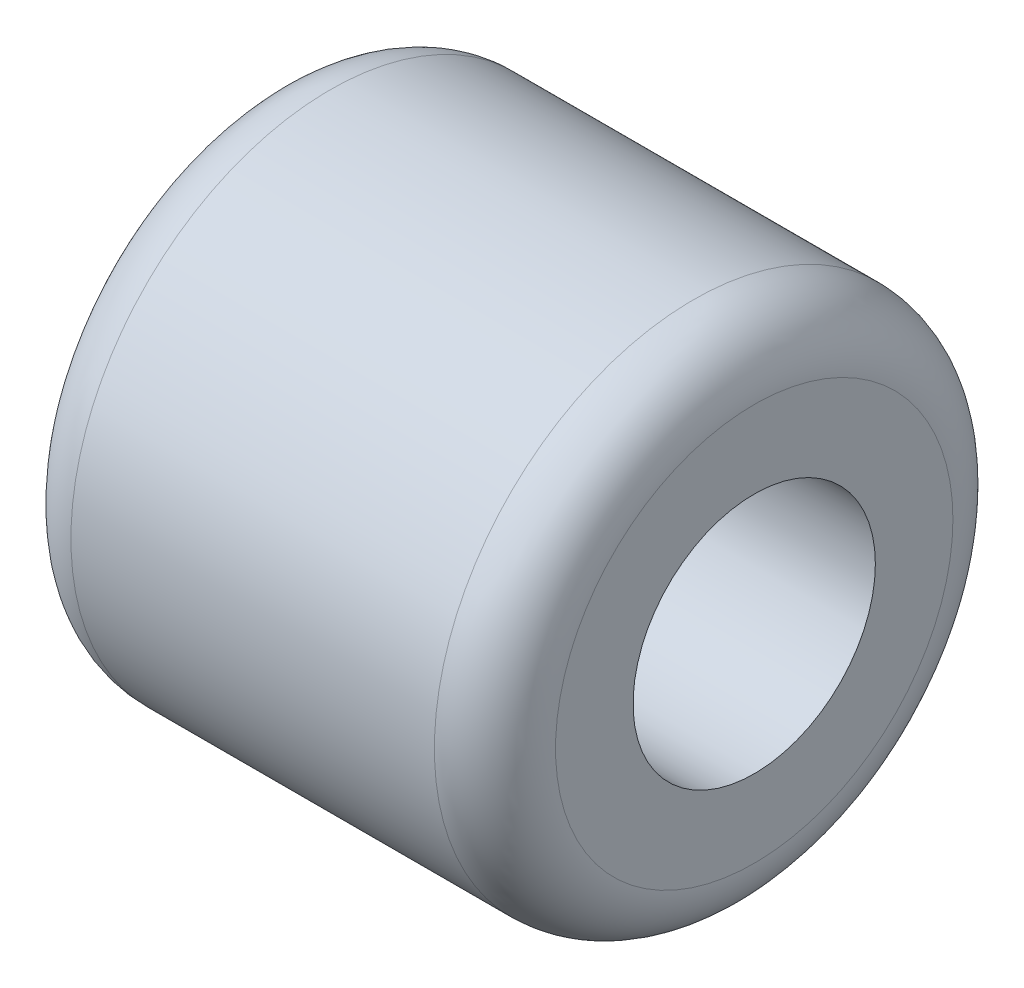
from build123d import *

# Parameters (mm, degrees)
SKETCH1_R      = 5.4356
SKETCH1_R_2    = 2.54
EXTRUDE1_DEPTH = 5.08
FILLET1_R      = 1.27


with BuildPart() as part:
    # Sketch1 → Extrude1 (new, symmetric)
    with BuildSketch(Plane(origin=(0, 0, 0), x_dir=(0, 0, -1), z_dir=(1, 0, 0))):
        Circle(SKETCH1_R)
        Circle(SKETCH1_R_2, mode=Mode.SUBTRACT)
    extrude(amount=EXTRUDE1_DEPTH, both=True)

    # Fillet1
    fillet1_edges = [part.edges().sort_by_distance(p)[0] for p in [
        (-5.08, 0, 5.4356),
        (5.08, 0, 5.4356),
    ]]
    fillet(fillet1_edges, radius=FILLET1_R)


solid = part.part
